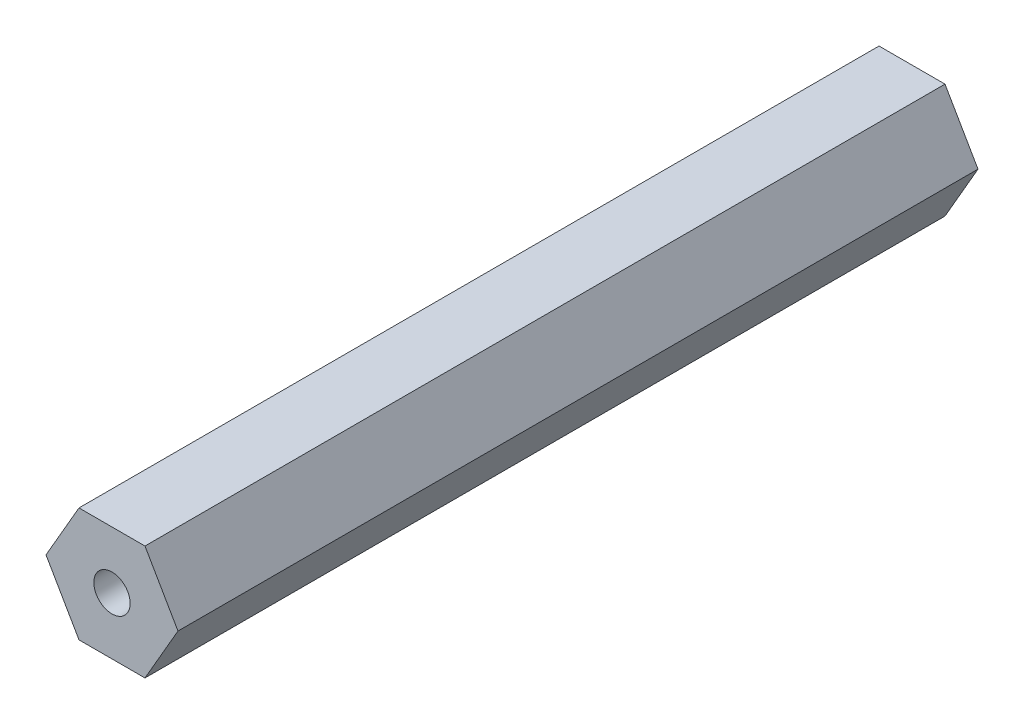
ISO-10303-21;
HEADER;
FILE_DESCRIPTION(('STEP AP214'),'2;1');
FILE_NAME('part.step','',(''),(''),'','','');
FILE_SCHEMA(('AUTOMOTIVE_DESIGN { 1 0 10303 214 1 1 1 1 }'));
ENDSEC;
DATA;
#1=APPLICATION_CONTEXT('core data for automotive mechanical design processes');
#2=APPLICATION_PROTOCOL_DEFINITION('international standard','automotive_design',2000,#1);
#3=PRODUCT_CONTEXT('',#1,'mechanical');
#4=PRODUCT('Part','Part','',(#3));
#5=PRODUCT_RELATED_PRODUCT_CATEGORY('part','',(#4));
#6=PRODUCT_DEFINITION_FORMATION('','',#4);
#7=PRODUCT_DEFINITION_CONTEXT('part definition',#1,'design');
#8=PRODUCT_DEFINITION('design','',#6,#7);
#9=PRODUCT_DEFINITION_SHAPE('','',#8);
#10=(LENGTH_UNIT() NAMED_UNIT(*) SI_UNIT(.MILLI.,.METRE.));
#11=(NAMED_UNIT(*) PLANE_ANGLE_UNIT() SI_UNIT($,.RADIAN.));
#12=(NAMED_UNIT(*) SI_UNIT($,.STERADIAN.) SOLID_ANGLE_UNIT());
#13=UNCERTAINTY_MEASURE_WITH_UNIT(LENGTH_MEASURE(1.E-05),#10,'distance_accuracy_value','');
#14=(GEOMETRIC_REPRESENTATION_CONTEXT(3) GLOBAL_UNCERTAINTY_ASSIGNED_CONTEXT((#13)) GLOBAL_UNIT_ASSIGNED_CONTEXT((#10,
#11,#12)) REPRESENTATION_CONTEXT('',''));
#15=CARTESIAN_POINT('',(0.,0.,0.));
#16=DIRECTION('',(0.,0.,1.));
#17=DIRECTION('',(1.,0.,0.));
#18=AXIS2_PLACEMENT_3D('',#15,#16,#17);
#19=CARTESIAN_POINT('',(3.66617420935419,-6.34999999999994,88.9));
#20=DIRECTION('',(-0.866025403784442,0.499999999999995,0.));
#21=DIRECTION('',(-0.499999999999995,-0.866025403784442,0.));
#22=AXIS2_PLACEMENT_3D('',#19,#20,#21);
#23=PLANE('',#22);
#24=DIRECTION('',(0.499999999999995,0.866025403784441,0.));
#25=VECTOR('',#24,1.);
#26=CARTESIAN_POINT('',(3.66617420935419,-6.34999999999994,0.));
#27=LINE('',#26,#25);
#28=CARTESIAN_POINT('',(3.66617420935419,-6.34999999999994,0.));
#29=VERTEX_POINT('',#28);
#30=CARTESIAN_POINT('',(7.33234841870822,0.,0.));
#31=VERTEX_POINT('',#30);
#32=EDGE_CURVE('E124',#29,#31,#27,.T.);
#33=ORIENTED_EDGE('',*,*,#32,.T.);
#34=DIRECTION('',(0.,0.,-1.));
#35=VECTOR('',#34,1.);
#36=CARTESIAN_POINT('',(7.33234841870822,0.,88.9));
#37=LINE('',#36,#35);
#38=CARTESIAN_POINT('',(7.33234841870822,0.,88.9));
#39=VERTEX_POINT('',#38);
#40=EDGE_CURVE('E11',#39,#31,#37,.T.);
#41=ORIENTED_EDGE('',*,*,#40,.F.);
#42=DIRECTION('',(0.499999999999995,0.866025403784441,0.));
#43=VECTOR('',#42,1.);
#44=CARTESIAN_POINT('',(3.66617420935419,-6.34999999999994,88.9));
#45=LINE('',#44,#43);
#46=CARTESIAN_POINT('',(3.66617420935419,-6.34999999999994,88.9));
#47=VERTEX_POINT('',#46);
#48=EDGE_CURVE('E135',#47,#39,#45,.T.);
#49=ORIENTED_EDGE('',*,*,#48,.F.);
#50=DIRECTION('',(0.,0.,-1.));
#51=VECTOR('',#50,1.);
#52=CARTESIAN_POINT('',(3.66617420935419,-6.34999999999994,88.9));
#53=LINE('',#52,#51);
#54=EDGE_CURVE('E120',#47,#29,#53,.T.);
#55=ORIENTED_EDGE('',*,*,#54,.T.);
#56=EDGE_LOOP('',(#33,#41,#49,#55));
#57=FACE_BOUND('',#56,.T.);
#58=ADVANCED_FACE('F37',(#57),#23,.F.);
#59=CARTESIAN_POINT('',(7.33234841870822,0.,88.9));
#60=DIRECTION('',(-0.866025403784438,-0.500000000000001,0.));
#61=DIRECTION('',(0.500000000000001,-0.866025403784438,0.));
#62=AXIS2_PLACEMENT_3D('',#59,#60,#61);
#63=PLANE('',#62);
#64=DIRECTION('',(-0.500000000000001,0.866025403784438,0.));
#65=VECTOR('',#64,1.);
#66=CARTESIAN_POINT('',(7.33234841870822,0.,0.));
#67=LINE('',#66,#65);
#68=CARTESIAN_POINT('',(3.6661742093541,6.34999999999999,0.));
#69=VERTEX_POINT('',#68);
#70=EDGE_CURVE('E127',#31,#69,#67,.T.);
#71=ORIENTED_EDGE('',*,*,#70,.T.);
#72=DIRECTION('',(0.,0.,-1.));
#73=VECTOR('',#72,1.);
#74=CARTESIAN_POINT('',(3.6661742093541,6.34999999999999,88.9));
#75=LINE('',#74,#73);
#76=CARTESIAN_POINT('',(3.6661742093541,6.34999999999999,88.9));
#77=VERTEX_POINT('',#76);
#78=EDGE_CURVE('E45',#77,#69,#75,.T.);
#79=ORIENTED_EDGE('',*,*,#78,.F.);
#80=DIRECTION('',(-0.500000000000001,0.866025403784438,0.));
#81=VECTOR('',#80,1.);
#82=CARTESIAN_POINT('',(7.33234841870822,0.,88.9));
#83=LINE('',#82,#81);
#84=EDGE_CURVE('E91',#39,#77,#83,.T.);
#85=ORIENTED_EDGE('',*,*,#84,.F.);
#86=ORIENTED_EDGE('',*,*,#40,.T.);
#87=EDGE_LOOP('',(#71,#79,#85,#86));
#88=FACE_BOUND('',#87,.T.);
#89=ADVANCED_FACE('F160',(#88),#63,.F.);
#90=CARTESIAN_POINT('',(3.6661742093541,6.34999999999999,88.9));
#91=DIRECTION('',(0.,-1.,0.));
#92=DIRECTION('',(1.,0.,0.));
#93=AXIS2_PLACEMENT_3D('',#90,#91,#92);
#94=PLANE('',#93);
#95=DIRECTION('',(-1.,0.,0.));
#96=VECTOR('',#95,1.);
#97=CARTESIAN_POINT('',(3.6661742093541,6.34999999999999,0.));
#98=LINE('',#97,#96);
#99=CARTESIAN_POINT('',(-3.66617420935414,6.34999999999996,0.));
#100=VERTEX_POINT('',#99);
#101=EDGE_CURVE('E130',#69,#100,#98,.T.);
#102=ORIENTED_EDGE('',*,*,#101,.T.);
#103=DIRECTION('',(0.,0.,-1.));
#104=VECTOR('',#103,1.);
#105=CARTESIAN_POINT('',(-3.66617420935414,6.34999999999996,88.9));
#106=LINE('',#105,#104);
#107=CARTESIAN_POINT('',(-3.66617420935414,6.34999999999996,88.9));
#108=VERTEX_POINT('',#107);
#109=EDGE_CURVE('E115',#108,#100,#106,.T.);
#110=ORIENTED_EDGE('',*,*,#109,.F.);
#111=DIRECTION('',(-1.,0.,0.));
#112=VECTOR('',#111,1.);
#113=CARTESIAN_POINT('',(3.6661742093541,6.34999999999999,88.9));
#114=LINE('',#113,#112);
#115=EDGE_CURVE('E106',#77,#108,#114,.T.);
#116=ORIENTED_EDGE('',*,*,#115,.F.);
#117=ORIENTED_EDGE('',*,*,#78,.T.);
#118=EDGE_LOOP('',(#102,#110,#116,#117));
#119=FACE_BOUND('',#118,.T.);
#120=ADVANCED_FACE('F141',(#119),#94,.F.);
#121=CARTESIAN_POINT('',(-3.66617420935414,6.34999999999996,88.9));
#122=DIRECTION('',(0.866025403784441,-0.499999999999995,0.));
#123=DIRECTION('',(0.499999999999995,0.866025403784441,0.));
#124=AXIS2_PLACEMENT_3D('',#121,#122,#123);
#125=PLANE('',#124);
#126=DIRECTION('',(-0.499999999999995,-0.866025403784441,0.));
#127=VECTOR('',#126,1.);
#128=CARTESIAN_POINT('',(-3.66617420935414,6.34999999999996,0.));
#129=LINE('',#128,#127);
#130=CARTESIAN_POINT('',(-7.33234841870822,0.,0.));
#131=VERTEX_POINT('',#130);
#132=EDGE_CURVE('E114',#100,#131,#129,.T.);
#133=ORIENTED_EDGE('',*,*,#132,.T.);
#134=DIRECTION('',(0.,0.,-1.));
#135=VECTOR('',#134,1.);
#136=CARTESIAN_POINT('',(-7.33234841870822,0.,88.9));
#137=LINE('',#136,#135);
#138=CARTESIAN_POINT('',(-7.33234841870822,0.,88.9));
#139=VERTEX_POINT('',#138);
#140=EDGE_CURVE('E111',#139,#131,#137,.T.);
#141=ORIENTED_EDGE('',*,*,#140,.F.);
#142=DIRECTION('',(-0.499999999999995,-0.866025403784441,0.));
#143=VECTOR('',#142,1.);
#144=CARTESIAN_POINT('',(-3.66617420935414,6.34999999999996,88.9));
#145=LINE('',#144,#143);
#146=EDGE_CURVE('E100',#108,#139,#145,.T.);
#147=ORIENTED_EDGE('',*,*,#146,.F.);
#148=ORIENTED_EDGE('',*,*,#109,.T.);
#149=EDGE_LOOP('',(#133,#141,#147,#148));
#150=FACE_BOUND('',#149,.T.);
#151=ADVANCED_FACE('F112',(#150),#125,.F.);
#152=CARTESIAN_POINT('',(-7.33234841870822,0.,88.9));
#153=DIRECTION('',(0.866025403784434,0.500000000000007,0.));
#154=DIRECTION('',(-0.500000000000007,0.866025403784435,0.));
#155=AXIS2_PLACEMENT_3D('',#152,#153,#154);
#156=PLANE('',#155);
#157=DIRECTION('',(0.500000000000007,-0.866025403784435,0.));
#158=VECTOR('',#157,1.);
#159=CARTESIAN_POINT('',(-7.33234841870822,0.,0.));
#160=LINE('',#159,#158);
#161=CARTESIAN_POINT('',(-3.66617420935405,-6.35000000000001,0.));
#162=VERTEX_POINT('',#161);
#163=EDGE_CURVE('E77',#131,#162,#160,.T.);
#164=ORIENTED_EDGE('',*,*,#163,.T.);
#165=DIRECTION('',(0.,0.,-1.));
#166=VECTOR('',#165,1.);
#167=CARTESIAN_POINT('',(-3.66617420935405,-6.35000000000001,88.9));
#168=LINE('',#167,#166);
#169=CARTESIAN_POINT('',(-3.66617420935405,-6.35000000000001,88.9));
#170=VERTEX_POINT('',#169);
#171=EDGE_CURVE('E116',#170,#162,#168,.T.);
#172=ORIENTED_EDGE('',*,*,#171,.F.);
#173=DIRECTION('',(0.500000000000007,-0.866025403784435,0.));
#174=VECTOR('',#173,1.);
#175=CARTESIAN_POINT('',(-7.33234841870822,0.,88.9));
#176=LINE('',#175,#174);
#177=EDGE_CURVE('E104',#139,#170,#176,.T.);
#178=ORIENTED_EDGE('',*,*,#177,.F.);
#179=ORIENTED_EDGE('',*,*,#140,.T.);
#180=EDGE_LOOP('',(#164,#172,#178,#179));
#181=FACE_BOUND('',#180,.T.);
#182=ADVANCED_FACE('F118',(#181),#156,.F.);
#183=CARTESIAN_POINT('',(-3.66617420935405,-6.35000000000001,88.9));
#184=DIRECTION('',(0.,1.,0.));
#185=DIRECTION('',(-1.,0.,0.));
#186=AXIS2_PLACEMENT_3D('',#183,#184,#185);
#187=PLANE('',#186);
#188=DIRECTION('',(1.,0.,0.));
#189=VECTOR('',#188,1.);
#190=CARTESIAN_POINT('',(-3.66617420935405,-6.35000000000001,0.));
#191=LINE('',#190,#189);
#192=EDGE_CURVE('E83',#162,#29,#191,.T.);
#193=ORIENTED_EDGE('',*,*,#192,.T.);
#194=ORIENTED_EDGE('',*,*,#54,.F.);
#195=DIRECTION('',(1.,0.,0.));
#196=VECTOR('',#195,1.);
#197=CARTESIAN_POINT('',(-3.66617420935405,-6.35000000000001,88.9));
#198=LINE('',#197,#196);
#199=EDGE_CURVE('E53',#170,#47,#198,.T.);
#200=ORIENTED_EDGE('',*,*,#199,.F.);
#201=ORIENTED_EDGE('',*,*,#171,.T.);
#202=EDGE_LOOP('',(#193,#194,#200,#201));
#203=FACE_BOUND('',#202,.T.);
#204=ADVANCED_FACE('F148',(#203),#187,.F.);
#205=CARTESIAN_POINT('',(0.,0.,88.9));
#206=DIRECTION('',(0.,0.,1.));
#207=DIRECTION('',(1.,0.,0.));
#208=AXIS2_PLACEMENT_3D('',#205,#206,#207);
#209=PLANE('',#208);
#210=CARTESIAN_POINT('',(0.,0.,88.9));
#211=DIRECTION('',(0.,0.,1.));
#212=DIRECTION('',(1.,0.,0.));
#213=AXIS2_PLACEMENT_3D('',#210,#211,#212);
#214=CIRCLE('',#213,2.01929999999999);
#215=CARTESIAN_POINT('',(2.01929999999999,0.,88.9));
#216=VERTEX_POINT('',#215);
#217=EDGE_CURVE('E253',#216,#216,#214,.T.);
#218=ORIENTED_EDGE('',*,*,#217,.F.);
#219=EDGE_LOOP('',(#218));
#220=FACE_BOUND('',#219,.T.);
#221=ORIENTED_EDGE('',*,*,#48,.T.);
#222=ORIENTED_EDGE('',*,*,#84,.T.);
#223=ORIENTED_EDGE('',*,*,#115,.T.);
#224=ORIENTED_EDGE('',*,*,#146,.T.);
#225=ORIENTED_EDGE('',*,*,#177,.T.);
#226=ORIENTED_EDGE('',*,*,#199,.T.);
#227=EDGE_LOOP('',(#221,#222,#223,#224,#225,#226));
#228=FACE_BOUND('',#227,.T.);
#229=ADVANCED_FACE('F102',(#220,#228),#209,.T.);
#230=CARTESIAN_POINT('',(0.,0.,0.));
#231=DIRECTION('',(0.,0.,1.));
#232=DIRECTION('',(1.,0.,0.));
#233=AXIS2_PLACEMENT_3D('',#230,#231,#232);
#234=PLANE('',#233);
#235=CARTESIAN_POINT('',(0.,0.,0.));
#236=DIRECTION('',(0.,0.,-1.));
#237=DIRECTION('',(-1.,0.,0.));
#238=AXIS2_PLACEMENT_3D('',#235,#236,#237);
#239=CIRCLE('',#238,2.01929999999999);
#240=CARTESIAN_POINT('',(-2.01929999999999,0.,0.));
#241=VERTEX_POINT('',#240);
#242=EDGE_CURVE('E251',#241,#241,#239,.T.);
#243=ORIENTED_EDGE('',*,*,#242,.F.);
#244=EDGE_LOOP('',(#243));
#245=FACE_BOUND('',#244,.T.);
#246=ORIENTED_EDGE('',*,*,#32,.F.);
#247=ORIENTED_EDGE('',*,*,#192,.F.);
#248=ORIENTED_EDGE('',*,*,#163,.F.);
#249=ORIENTED_EDGE('',*,*,#132,.F.);
#250=ORIENTED_EDGE('',*,*,#101,.F.);
#251=ORIENTED_EDGE('',*,*,#70,.F.);
#252=EDGE_LOOP('',(#246,#247,#248,#249,#250,#251));
#253=FACE_BOUND('',#252,.T.);
#254=ADVANCED_FACE('F144',(#245,#253),#234,.F.);
#255=CARTESIAN_POINT('',(0.,0.,76.2));
#256=DIRECTION('',(0.,0.,1.));
#257=DIRECTION('',(1.,0.,0.));
#258=AXIS2_PLACEMENT_3D('',#255,#256,#257);
#259=CONICAL_SURFACE('',#258,2.0193,1.02974425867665);
#260=CARTESIAN_POINT('',(0.,0.,74.9866821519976));
#261=VERTEX_POINT('',#260);
#262=VERTEX_LOOP('',#261);
#263=FACE_BOUND('',#262,.T.);
#264=CARTESIAN_POINT('',(0.,0.,76.2));
#265=DIRECTION('',(0.,0.,1.));
#266=DIRECTION('',(1.,0.,0.));
#267=AXIS2_PLACEMENT_3D('',#264,#265,#266);
#268=CIRCLE('',#267,2.0193);
#269=CARTESIAN_POINT('',(2.0193,0.,76.2));
#270=VERTEX_POINT('',#269);
#271=EDGE_CURVE('E128',#270,#270,#268,.T.);
#272=ORIENTED_EDGE('',*,*,#271,.T.);
#273=EDGE_LOOP('',(#272));
#274=FACE_BOUND('',#273,.T.);
#275=ADVANCED_FACE('F195',(#263,#274),#259,.F.);
#276=CARTESIAN_POINT('',(0.,0.,88.9));
#277=DIRECTION('',(0.,0.,1.));
#278=DIRECTION('',(1.,0.,0.));
#279=AXIS2_PLACEMENT_3D('',#276,#277,#278);
#280=CYLINDRICAL_SURFACE('',#279,2.01929999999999);
#281=ORIENTED_EDGE('',*,*,#271,.F.);
#282=EDGE_LOOP('',(#281));
#283=FACE_BOUND('',#282,.T.);
#284=ORIENTED_EDGE('',*,*,#217,.T.);
#285=EDGE_LOOP('',(#284));
#286=FACE_BOUND('',#285,.T.);
#287=ADVANCED_FACE('F200',(#283,#286),#280,.F.);
#288=CARTESIAN_POINT('',(0.,0.,12.7));
#289=DIRECTION('',(0.,0.,-1.));
#290=DIRECTION('',(-1.,0.,0.));
#291=AXIS2_PLACEMENT_3D('',#288,#289,#290);
#292=CONICAL_SURFACE('',#291,2.01929999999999,1.02974425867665);
#293=CARTESIAN_POINT('',(0.,0.,13.9133178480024));
#294=VERTEX_POINT('',#293);
#295=VERTEX_LOOP('',#294);
#296=FACE_BOUND('',#295,.T.);
#297=CARTESIAN_POINT('',(0.,0.,12.7));
#298=DIRECTION('',(0.,0.,-1.));
#299=DIRECTION('',(-1.,0.,0.));
#300=AXIS2_PLACEMENT_3D('',#297,#298,#299);
#301=CIRCLE('',#300,2.01929999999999);
#302=CARTESIAN_POINT('',(-2.01929999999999,0.,12.7));
#303=VERTEX_POINT('',#302);
#304=EDGE_CURVE('E248',#303,#303,#301,.T.);
#305=ORIENTED_EDGE('',*,*,#304,.T.);
#306=EDGE_LOOP('',(#305));
#307=FACE_BOUND('',#306,.T.);
#308=ADVANCED_FACE('F211',(#296,#307),#292,.F.);
#309=CARTESIAN_POINT('',(0.,0.,0.));
#310=DIRECTION('',(0.,0.,-1.));
#311=DIRECTION('',(-1.,0.,0.));
#312=AXIS2_PLACEMENT_3D('',#309,#310,#311);
#313=CYLINDRICAL_SURFACE('',#312,2.01929999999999);
#314=ORIENTED_EDGE('',*,*,#304,.F.);
#315=EDGE_LOOP('',(#314));
#316=FACE_BOUND('',#315,.T.);
#317=ORIENTED_EDGE('',*,*,#242,.T.);
#318=EDGE_LOOP('',(#317));
#319=FACE_BOUND('',#318,.T.);
#320=ADVANCED_FACE('F230',(#316,#319),#313,.F.);
#321=CLOSED_SHELL('',(#58,#89,#120,#151,#182,#204,#229,#254,#275,#287,#308,#320));
#322=MANIFOLD_SOLID_BREP('B2',#321);
#323=ADVANCED_BREP_SHAPE_REPRESENTATION('',(#18,#322),#14);
#324=SHAPE_DEFINITION_REPRESENTATION(#9,#323);
ENDSEC;
END-ISO-10303-21;
